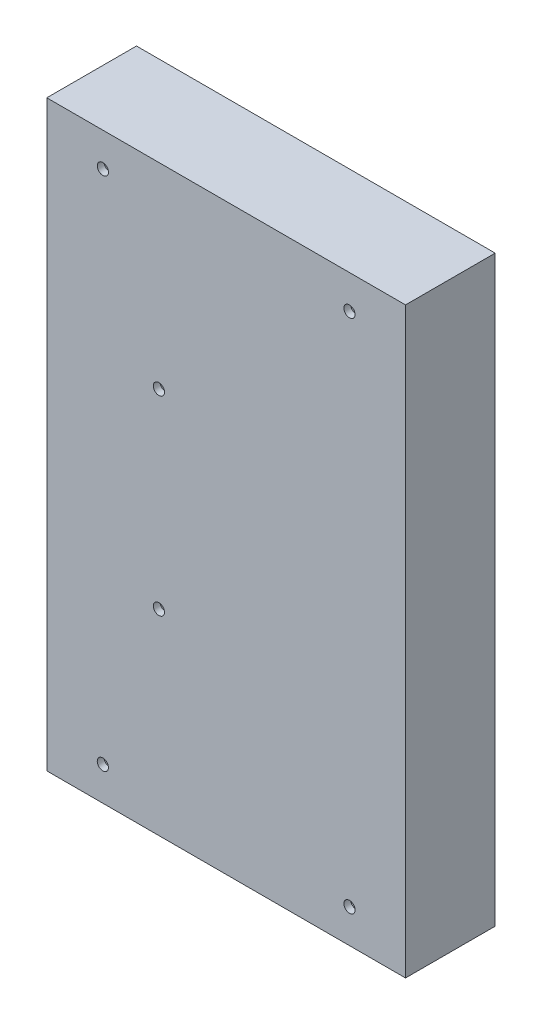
ISO-10303-21;
HEADER;
FILE_DESCRIPTION(('STEP AP214'),'2;1');
FILE_NAME('part.step','',(''),(''),'','','');
FILE_SCHEMA(('AUTOMOTIVE_DESIGN { 1 0 10303 214 1 1 1 1 }'));
ENDSEC;
DATA;
#1=APPLICATION_CONTEXT('core data for automotive mechanical design processes');
#2=APPLICATION_PROTOCOL_DEFINITION('international standard','automotive_design',2000,#1);
#3=PRODUCT_CONTEXT('',#1,'mechanical');
#4=PRODUCT('Part','Part','',(#3));
#5=PRODUCT_RELATED_PRODUCT_CATEGORY('part','',(#4));
#6=PRODUCT_DEFINITION_FORMATION('','',#4);
#7=PRODUCT_DEFINITION_CONTEXT('part definition',#1,'design');
#8=PRODUCT_DEFINITION('design','',#6,#7);
#9=PRODUCT_DEFINITION_SHAPE('','',#8);
#10=(LENGTH_UNIT() NAMED_UNIT(*) SI_UNIT(.MILLI.,.METRE.));
#11=(NAMED_UNIT(*) PLANE_ANGLE_UNIT() SI_UNIT($,.RADIAN.));
#12=(NAMED_UNIT(*) SI_UNIT($,.STERADIAN.) SOLID_ANGLE_UNIT());
#13=UNCERTAINTY_MEASURE_WITH_UNIT(LENGTH_MEASURE(1.E-05),#10,'distance_accuracy_value','');
#14=(GEOMETRIC_REPRESENTATION_CONTEXT(3) GLOBAL_UNCERTAINTY_ASSIGNED_CONTEXT((#13)) GLOBAL_UNIT_ASSIGNED_CONTEXT((#10,
#11,#12)) REPRESENTATION_CONTEXT('',''));
#15=CARTESIAN_POINT('',(0.,0.,0.));
#16=DIRECTION('',(0.,0.,1.));
#17=DIRECTION('',(1.,0.,0.));
#18=AXIS2_PLACEMENT_3D('',#15,#16,#17);
#19=CARTESIAN_POINT('',(-75.,-125.,25.));
#20=DIRECTION('',(1.,0.,0.));
#21=DIRECTION('',(0.,0.,-1.));
#22=AXIS2_PLACEMENT_3D('',#19,#20,#21);
#23=PLANE('',#22);
#24=DIRECTION('',(0.,0.,-1.));
#25=VECTOR('',#24,1.);
#26=CARTESIAN_POINT('',(-75.,125.,25.));
#27=LINE('',#26,#25);
#28=CARTESIAN_POINT('',(-75.,125.,20.));
#29=VERTEX_POINT('',#28);
#30=CARTESIAN_POINT('',(-75.,125.,10.));
#31=VERTEX_POINT('',#30);
#32=EDGE_CURVE('E200',#29,#31,#27,.T.);
#33=ORIENTED_EDGE('',*,*,#32,.F.);
#34=DIRECTION('',(0.,-1.,0.));
#35=VECTOR('',#34,1.);
#36=CARTESIAN_POINT('',(-75.,-125.,20.));
#37=LINE('',#36,#35);
#38=CARTESIAN_POINT('',(-75.,-125.,20.));
#39=VERTEX_POINT('',#38);
#40=EDGE_CURVE('E60',#29,#39,#37,.T.);
#41=ORIENTED_EDGE('',*,*,#40,.T.);
#42=DIRECTION('',(0.,0.,-1.));
#43=VECTOR('',#42,1.);
#44=CARTESIAN_POINT('',(-75.,-125.,25.));
#45=LINE('',#44,#43);
#46=CARTESIAN_POINT('',(-75.,-125.,10.));
#47=VERTEX_POINT('',#46);
#48=EDGE_CURVE('E66',#39,#47,#45,.T.);
#49=ORIENTED_EDGE('',*,*,#48,.T.);
#50=DIRECTION('',(0.,-1.,0.));
#51=VECTOR('',#50,1.);
#52=CARTESIAN_POINT('',(-75.,-125.,10.));
#53=LINE('',#52,#51);
#54=EDGE_CURVE('E535',#31,#47,#53,.T.);
#55=ORIENTED_EDGE('',*,*,#54,.F.);
#56=EDGE_LOOP('',(#33,#41,#49,#55));
#57=FACE_BOUND('',#56,.T.);
#58=ADVANCED_FACE('F45',(#57),#23,.T.);
#59=CARTESIAN_POINT('',(75.,-125.,25.));
#60=DIRECTION('',(0.,1.,0.));
#61=DIRECTION('',(0.,0.,1.));
#62=AXIS2_PLACEMENT_3D('',#59,#60,#61);
#63=PLANE('',#62);
#64=ORIENTED_EDGE('',*,*,#48,.F.);
#65=DIRECTION('',(1.,0.,0.));
#66=VECTOR('',#65,1.);
#67=CARTESIAN_POINT('',(75.,-125.,20.));
#68=LINE('',#67,#66);
#69=CARTESIAN_POINT('',(75.,-125.,20.));
#70=VERTEX_POINT('',#69);
#71=EDGE_CURVE('E193',#39,#70,#68,.T.);
#72=ORIENTED_EDGE('',*,*,#71,.T.);
#73=DIRECTION('',(0.,0.,-1.));
#74=VECTOR('',#73,1.);
#75=CARTESIAN_POINT('',(75.,-125.,25.));
#76=LINE('',#75,#74);
#77=CARTESIAN_POINT('',(75.,-125.,10.));
#78=VERTEX_POINT('',#77);
#79=EDGE_CURVE('E192',#70,#78,#76,.T.);
#80=ORIENTED_EDGE('',*,*,#79,.T.);
#81=DIRECTION('',(1.,0.,0.));
#82=VECTOR('',#81,1.);
#83=CARTESIAN_POINT('',(75.,-125.,10.));
#84=LINE('',#83,#82);
#85=EDGE_CURVE('E954',#47,#78,#84,.T.);
#86=ORIENTED_EDGE('',*,*,#85,.F.);
#87=EDGE_LOOP('',(#64,#72,#80,#86));
#88=FACE_BOUND('',#87,.T.);
#89=ADVANCED_FACE('F416',(#88),#63,.T.);
#90=CARTESIAN_POINT('',(75.,-125.,25.));
#91=DIRECTION('',(-1.,0.,0.));
#92=DIRECTION('',(0.,0.,1.));
#93=AXIS2_PLACEMENT_3D('',#90,#91,#92);
#94=PLANE('',#93);
#95=ORIENTED_EDGE('',*,*,#79,.F.);
#96=DIRECTION('',(0.,1.,0.));
#97=VECTOR('',#96,1.);
#98=CARTESIAN_POINT('',(75.,-125.,20.));
#99=LINE('',#98,#97);
#100=CARTESIAN_POINT('',(75.,125.,20.));
#101=VERTEX_POINT('',#100);
#102=EDGE_CURVE('E181',#70,#101,#99,.T.);
#103=ORIENTED_EDGE('',*,*,#102,.T.);
#104=DIRECTION('',(0.,0.,-1.));
#105=VECTOR('',#104,1.);
#106=CARTESIAN_POINT('',(75.,125.,25.));
#107=LINE('',#106,#105);
#108=CARTESIAN_POINT('',(75.,125.,10.));
#109=VERTEX_POINT('',#108);
#110=EDGE_CURVE('E190',#101,#109,#107,.T.);
#111=ORIENTED_EDGE('',*,*,#110,.T.);
#112=DIRECTION('',(0.,1.,0.));
#113=VECTOR('',#112,1.);
#114=CARTESIAN_POINT('',(75.,-125.,10.));
#115=LINE('',#114,#113);
#116=EDGE_CURVE('E956',#78,#109,#115,.T.);
#117=ORIENTED_EDGE('',*,*,#116,.F.);
#118=EDGE_LOOP('',(#95,#103,#111,#117));
#119=FACE_BOUND('',#118,.T.);
#120=ADVANCED_FACE('F188',(#119),#94,.T.);
#121=CARTESIAN_POINT('',(75.,125.,25.));
#122=DIRECTION('',(0.,-1.,0.));
#123=DIRECTION('',(0.,0.,-1.));
#124=AXIS2_PLACEMENT_3D('',#121,#122,#123);
#125=PLANE('',#124);
#126=ORIENTED_EDGE('',*,*,#110,.F.);
#127=DIRECTION('',(-1.,0.,0.));
#128=VECTOR('',#127,1.);
#129=CARTESIAN_POINT('',(75.,125.,20.));
#130=LINE('',#129,#128);
#131=EDGE_CURVE('E11',#101,#29,#130,.T.);
#132=ORIENTED_EDGE('',*,*,#131,.T.);
#133=ORIENTED_EDGE('',*,*,#32,.T.);
#134=DIRECTION('',(-1.,0.,0.));
#135=VECTOR('',#134,1.);
#136=CARTESIAN_POINT('',(75.,125.,10.));
#137=LINE('',#136,#135);
#138=EDGE_CURVE('E199',#109,#31,#137,.T.);
#139=ORIENTED_EDGE('',*,*,#138,.F.);
#140=EDGE_LOOP('',(#126,#132,#133,#139));
#141=FACE_BOUND('',#140,.T.);
#142=ADVANCED_FACE('F197',(#141),#125,.T.);
#143=CARTESIAN_POINT('',(0.,0.,0.));
#144=DIRECTION('',(0.,0.,1.));
#145=DIRECTION('',(1.,0.,0.));
#146=AXIS2_PLACEMENT_3D('',#143,#144,#145);
#147=PLANE('',#146);
#148=CARTESIAN_POINT('',(50.,100.,0.));
#149=DIRECTION('',(0.,0.,1.));
#150=DIRECTION('',(-1.,0.,0.));
#151=AXIS2_PLACEMENT_3D('',#148,#149,#150);
#152=CIRCLE('',#151,19.5);
#153=CARTESIAN_POINT('',(30.5,100.,0.));
#154=VERTEX_POINT('',#153);
#155=EDGE_CURVE('E329',#154,#154,#152,.T.);
#156=ORIENTED_EDGE('',*,*,#155,.T.);
#157=EDGE_LOOP('',(#156));
#158=FACE_BOUND('',#157,.T.);
#159=CARTESIAN_POINT('',(50.,40.,0.));
#160=DIRECTION('',(0.,0.,1.));
#161=DIRECTION('',(-1.,0.,0.));
#162=AXIS2_PLACEMENT_3D('',#159,#160,#161);
#163=CIRCLE('',#162,19.5);
#164=CARTESIAN_POINT('',(30.5,40.,0.));
#165=VERTEX_POINT('',#164);
#166=EDGE_CURVE('E335',#165,#165,#163,.T.);
#167=ORIENTED_EDGE('',*,*,#166,.T.);
#168=EDGE_LOOP('',(#167));
#169=FACE_BOUND('',#168,.T.);
#170=CARTESIAN_POINT('',(50.,-20.,0.));
#171=DIRECTION('',(0.,0.,1.));
#172=DIRECTION('',(-1.,0.,0.));
#173=AXIS2_PLACEMENT_3D('',#170,#171,#172);
#174=CIRCLE('',#173,19.5);
#175=CARTESIAN_POINT('',(30.5,-20.,0.));
#176=VERTEX_POINT('',#175);
#177=EDGE_CURVE('E341',#176,#176,#174,.T.);
#178=ORIENTED_EDGE('',*,*,#177,.T.);
#179=EDGE_LOOP('',(#178));
#180=FACE_BOUND('',#179,.T.);
#181=DIRECTION('',(0.,-1.,0.));
#182=VECTOR('',#181,1.);
#183=CARTESIAN_POINT('',(5.,125.,0.));
#184=LINE('',#183,#182);
#185=CARTESIAN_POINT('',(5.,125.,0.));
#186=VERTEX_POINT('',#185);
#187=CARTESIAN_POINT('',(4.99999999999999,4.99999999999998,0.));
#188=VERTEX_POINT('',#187);
#189=EDGE_CURVE('E219',#186,#188,#184,.T.);
#190=ORIENTED_EDGE('',*,*,#189,.F.);
#191=DIRECTION('',(-1.,0.,0.));
#192=VECTOR('',#191,1.);
#193=CARTESIAN_POINT('',(75.,125.,0.));
#194=LINE('',#193,#192);
#195=CARTESIAN_POINT('',(75.,125.,0.));
#196=VERTEX_POINT('',#195);
#197=EDGE_CURVE('E53',#196,#186,#194,.T.);
#198=ORIENTED_EDGE('',*,*,#197,.F.);
#199=DIRECTION('',(0.,1.,0.));
#200=VECTOR('',#199,1.);
#201=CARTESIAN_POINT('',(75.,-125.,0.));
#202=LINE('',#201,#200);
#203=CARTESIAN_POINT('',(75.,-115.,0.));
#204=VERTEX_POINT('',#203);
#205=EDGE_CURVE('E373',#204,#196,#202,.T.);
#206=ORIENTED_EDGE('',*,*,#205,.F.);
#207=DIRECTION('',(0.503871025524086,-0.863778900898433,0.));
#208=VECTOR('',#207,1.);
#209=CARTESIAN_POINT('',(75.,-115.,0.));
#210=LINE('',#209,#208);
#211=EDGE_CURVE('E238',#188,#204,#210,.T.);
#212=ORIENTED_EDGE('',*,*,#211,.F.);
#213=EDGE_LOOP('',(#190,#198,#206,#212));
#214=FACE_BOUND('',#213,.T.);
#215=ADVANCED_FACE('F47',(#158,#169,#180,#214),#147,.F.);
#216=CARTESIAN_POINT('',(0.,-40.0000000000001,0.));
#217=DIRECTION('',(0.,0.,1.));
#218=DIRECTION('',(1.,0.,0.));
#219=AXIS2_PLACEMENT_3D('',#216,#217,#218);
#220=CIRCLE('',#219,19.5);
#221=CARTESIAN_POINT('',(19.5,-40.0000000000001,0.));
#222=VERTEX_POINT('',#221);
#223=EDGE_CURVE('E308',#222,#222,#220,.T.);
#224=ORIENTED_EDGE('',*,*,#223,.T.);
#225=EDGE_LOOP('',(#224));
#226=FACE_BOUND('',#225,.T.);
#227=CARTESIAN_POINT('',(29.9999999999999,-100.,0.));
#228=DIRECTION('',(0.,0.,1.));
#229=DIRECTION('',(-1.,0.,0.));
#230=AXIS2_PLACEMENT_3D('',#227,#228,#229);
#231=CIRCLE('',#230,19.5);
#232=CARTESIAN_POINT('',(10.4999999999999,-100.,0.));
#233=VERTEX_POINT('',#232);
#234=EDGE_CURVE('E317',#233,#233,#231,.T.);
#235=ORIENTED_EDGE('',*,*,#234,.T.);
#236=EDGE_LOOP('',(#235));
#237=FACE_BOUND('',#236,.T.);
#238=CARTESIAN_POINT('',(-29.9999999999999,-100.,0.));
#239=DIRECTION('',(0.,0.,1.));
#240=DIRECTION('',(1.,0.,0.));
#241=AXIS2_PLACEMENT_3D('',#238,#239,#240);
#242=CIRCLE('',#241,19.5);
#243=CARTESIAN_POINT('',(-10.4999999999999,-100.,0.));
#244=VERTEX_POINT('',#243);
#245=EDGE_CURVE('E323',#244,#244,#242,.T.);
#246=ORIENTED_EDGE('',*,*,#245,.T.);
#247=EDGE_LOOP('',(#246));
#248=FACE_BOUND('',#247,.T.);
#249=DIRECTION('',(-0.503871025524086,0.863778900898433,0.));
#250=VECTOR('',#249,1.);
#251=CARTESIAN_POINT('',(3.8302151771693,-2.9946545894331,0.));
#252=LINE('',#251,#250);
#253=CARTESIAN_POINT('',(75.,-125.,0.));
#254=VERTEX_POINT('',#253);
#255=CARTESIAN_POINT('',(3.8302151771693,-2.9946545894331,0.));
#256=VERTEX_POINT('',#255);
#257=EDGE_CURVE('E240',#254,#256,#252,.T.);
#258=ORIENTED_EDGE('',*,*,#257,.F.);
#259=DIRECTION('',(1.,0.,0.));
#260=VECTOR('',#259,1.);
#261=CARTESIAN_POINT('',(75.,-125.,0.));
#262=LINE('',#261,#260);
#263=CARTESIAN_POINT('',(-75.,-125.,0.));
#264=VERTEX_POINT('',#263);
#265=EDGE_CURVE('E370',#264,#254,#262,.T.);
#266=ORIENTED_EDGE('',*,*,#265,.F.);
#267=DIRECTION('',(-0.503871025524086,-0.863778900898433,0.));
#268=VECTOR('',#267,1.);
#269=CARTESIAN_POINT('',(-3.8302151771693,-2.9946545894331,0.));
#270=LINE('',#269,#268);
#271=CARTESIAN_POINT('',(-3.8302151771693,-2.9946545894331,0.));
#272=VERTEX_POINT('',#271);
#273=EDGE_CURVE('E244',#272,#264,#270,.T.);
#274=ORIENTED_EDGE('',*,*,#273,.F.);
#275=DIRECTION('',(-1.,0.,0.));
#276=VECTOR('',#275,1.);
#277=CARTESIAN_POINT('',(3.8302151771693,-2.9946545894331,0.));
#278=LINE('',#277,#276);
#279=EDGE_CURVE('E242',#256,#272,#278,.T.);
#280=ORIENTED_EDGE('',*,*,#279,.F.);
#281=EDGE_LOOP('',(#258,#266,#274,#280));
#282=FACE_BOUND('',#281,.T.);
#283=ADVANCED_FACE('F557',(#226,#237,#248,#282),#147,.F.);
#284=CARTESIAN_POINT('',(-50.,-20.,0.));
#285=DIRECTION('',(0.,0.,1.));
#286=DIRECTION('',(1.,0.,0.));
#287=AXIS2_PLACEMENT_3D('',#284,#285,#286);
#288=CIRCLE('',#287,19.5);
#289=CARTESIAN_POINT('',(-30.5,-20.,0.));
#290=VERTEX_POINT('',#289);
#291=EDGE_CURVE('E347',#290,#290,#288,.T.);
#292=ORIENTED_EDGE('',*,*,#291,.T.);
#293=EDGE_LOOP('',(#292));
#294=FACE_BOUND('',#293,.T.);
#295=CARTESIAN_POINT('',(-50.,40.,0.));
#296=DIRECTION('',(0.,0.,1.));
#297=DIRECTION('',(1.,0.,0.));
#298=AXIS2_PLACEMENT_3D('',#295,#296,#297);
#299=CIRCLE('',#298,19.5);
#300=CARTESIAN_POINT('',(-30.5,40.,0.));
#301=VERTEX_POINT('',#300);
#302=EDGE_CURVE('E353',#301,#301,#299,.T.);
#303=ORIENTED_EDGE('',*,*,#302,.T.);
#304=EDGE_LOOP('',(#303));
#305=FACE_BOUND('',#304,.T.);
#306=CARTESIAN_POINT('',(-50.,100.,0.));
#307=DIRECTION('',(0.,0.,1.));
#308=DIRECTION('',(1.,0.,0.));
#309=AXIS2_PLACEMENT_3D('',#306,#307,#308);
#310=CIRCLE('',#309,19.5);
#311=CARTESIAN_POINT('',(-30.5,100.,0.));
#312=VERTEX_POINT('',#311);
#313=EDGE_CURVE('E359',#312,#312,#310,.T.);
#314=ORIENTED_EDGE('',*,*,#313,.T.);
#315=EDGE_LOOP('',(#314));
#316=FACE_BOUND('',#315,.T.);
#317=DIRECTION('',(0.503871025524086,0.863778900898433,0.));
#318=VECTOR('',#317,1.);
#319=CARTESIAN_POINT('',(-75.,-115.,0.));
#320=LINE('',#319,#318);
#321=CARTESIAN_POINT('',(-75.,-115.,0.));
#322=VERTEX_POINT('',#321);
#323=CARTESIAN_POINT('',(-4.12771466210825,6.49534629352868,0.));
#324=VERTEX_POINT('',#323);
#325=EDGE_CURVE('E246',#322,#324,#320,.T.);
#326=ORIENTED_EDGE('',*,*,#325,.F.);
#327=DIRECTION('',(0.,-1.,0.));
#328=VECTOR('',#327,1.);
#329=CARTESIAN_POINT('',(-75.,-125.,0.));
#330=LINE('',#329,#328);
#331=CARTESIAN_POINT('',(-75.,125.,0.));
#332=VERTEX_POINT('',#331);
#333=EDGE_CURVE('E365',#332,#322,#330,.T.);
#334=ORIENTED_EDGE('',*,*,#333,.F.);
#335=CARTESIAN_POINT('',(-5.,125.,0.));
#336=VERTEX_POINT('',#335);
#337=EDGE_CURVE('E374',#336,#332,#194,.T.);
#338=ORIENTED_EDGE('',*,*,#337,.F.);
#339=DIRECTION('',(-0.00736056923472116,0.999972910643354,0.));
#340=VECTOR('',#339,1.);
#341=CARTESIAN_POINT('',(-5.,125.,0.));
#342=LINE('',#341,#340);
#343=EDGE_CURVE('E223',#324,#336,#342,.T.);
#344=ORIENTED_EDGE('',*,*,#343,.F.);
#345=EDGE_LOOP('',(#326,#334,#338,#344));
#346=FACE_BOUND('',#345,.T.);
#347=ADVANCED_FACE('F390',(#294,#305,#316,#346),#147,.F.);
#348=CARTESIAN_POINT('',(75.,125.,-15.));
#349=DIRECTION('',(0.,1.,0.));
#350=DIRECTION('',(0.,0.,1.));
#351=AXIS2_PLACEMENT_3D('',#348,#349,#350);
#352=PLANE('',#351);
#353=DIRECTION('',(0.,0.,1.));
#354=VECTOR('',#353,1.);
#355=CARTESIAN_POINT('',(5.,125.,-15.));
#356=LINE('',#355,#354);
#357=CARTESIAN_POINT('',(5.,125.,-15.));
#358=VERTEX_POINT('',#357);
#359=EDGE_CURVE('E268',#358,#186,#356,.T.);
#360=ORIENTED_EDGE('',*,*,#359,.F.);
#361=DIRECTION('',(-1.,0.,0.));
#362=VECTOR('',#361,1.);
#363=CARTESIAN_POINT('',(75.,125.,-15.));
#364=LINE('',#363,#362);
#365=CARTESIAN_POINT('',(75.,125.,-15.));
#366=VERTEX_POINT('',#365);
#367=EDGE_CURVE('E279',#366,#358,#364,.T.);
#368=ORIENTED_EDGE('',*,*,#367,.F.);
#369=DIRECTION('',(0.,0.,1.));
#370=VECTOR('',#369,1.);
#371=CARTESIAN_POINT('',(75.,125.,-15.));
#372=LINE('',#371,#370);
#373=EDGE_CURVE('E287',#366,#196,#372,.T.);
#374=ORIENTED_EDGE('',*,*,#373,.T.);
#375=ORIENTED_EDGE('',*,*,#197,.T.);
#376=EDGE_LOOP('',(#360,#368,#374,#375));
#377=FACE_BOUND('',#376,.T.);
#378=ADVANCED_FACE('F593',(#377),#352,.F.);
#379=DIRECTION('',(0.,0.,1.));
#380=VECTOR('',#379,1.);
#381=CARTESIAN_POINT('',(-5.,125.,-15.));
#382=LINE('',#381,#380);
#383=CARTESIAN_POINT('',(-5.,125.,-15.));
#384=VERTEX_POINT('',#383);
#385=EDGE_CURVE('E236',#384,#336,#382,.T.);
#386=ORIENTED_EDGE('',*,*,#385,.T.);
#387=ORIENTED_EDGE('',*,*,#337,.T.);
#388=DIRECTION('',(0.,0.,1.));
#389=VECTOR('',#388,1.);
#390=CARTESIAN_POINT('',(-75.,125.,-15.));
#391=LINE('',#390,#389);
#392=CARTESIAN_POINT('',(-75.,125.,-15.));
#393=VERTEX_POINT('',#392);
#394=EDGE_CURVE('E283',#393,#332,#391,.T.);
#395=ORIENTED_EDGE('',*,*,#394,.F.);
#396=EDGE_CURVE('E278',#384,#393,#364,.T.);
#397=ORIENTED_EDGE('',*,*,#396,.F.);
#398=EDGE_LOOP('',(#386,#387,#395,#397));
#399=FACE_BOUND('',#398,.T.);
#400=ADVANCED_FACE('F383',(#399),#352,.F.);
#401=CARTESIAN_POINT('',(-75.,-125.,-15.));
#402=DIRECTION('',(-1.,0.,0.));
#403=DIRECTION('',(0.,0.,1.));
#404=AXIS2_PLACEMENT_3D('',#401,#402,#403);
#405=PLANE('',#404);
#406=DIRECTION('',(0.,0.,1.));
#407=VECTOR('',#406,1.);
#408=CARTESIAN_POINT('',(-75.,-115.,-15.));
#409=LINE('',#408,#407);
#410=CARTESIAN_POINT('',(-75.,-115.,-15.));
#411=VERTEX_POINT('',#410);
#412=EDGE_CURVE('E254',#411,#322,#409,.T.);
#413=ORIENTED_EDGE('',*,*,#412,.F.);
#414=DIRECTION('',(0.,-1.,0.));
#415=VECTOR('',#414,1.);
#416=CARTESIAN_POINT('',(-75.,-125.,-15.));
#417=LINE('',#416,#415);
#418=EDGE_CURVE('E270',#393,#411,#417,.T.);
#419=ORIENTED_EDGE('',*,*,#418,.F.);
#420=ORIENTED_EDGE('',*,*,#394,.T.);
#421=ORIENTED_EDGE('',*,*,#333,.T.);
#422=EDGE_LOOP('',(#413,#419,#420,#421));
#423=FACE_BOUND('',#422,.T.);
#424=ADVANCED_FACE('F393',(#423),#405,.F.);
#425=CARTESIAN_POINT('',(75.,-125.,-15.));
#426=DIRECTION('',(1.,0.,0.));
#427=DIRECTION('',(0.,0.,-1.));
#428=AXIS2_PLACEMENT_3D('',#425,#426,#427);
#429=PLANE('',#428);
#430=DIRECTION('',(0.,0.,1.));
#431=VECTOR('',#430,1.);
#432=CARTESIAN_POINT('',(75.,-115.,-15.));
#433=LINE('',#432,#431);
#434=CARTESIAN_POINT('',(75.,-115.,-15.));
#435=VERTEX_POINT('',#434);
#436=EDGE_CURVE('E262',#435,#204,#433,.T.);
#437=ORIENTED_EDGE('',*,*,#436,.T.);
#438=ORIENTED_EDGE('',*,*,#205,.T.);
#439=ORIENTED_EDGE('',*,*,#373,.F.);
#440=DIRECTION('',(0.,1.,0.));
#441=VECTOR('',#440,1.);
#442=CARTESIAN_POINT('',(75.,-125.,-15.));
#443=LINE('',#442,#441);
#444=EDGE_CURVE('E276',#435,#366,#443,.T.);
#445=ORIENTED_EDGE('',*,*,#444,.F.);
#446=EDGE_LOOP('',(#437,#438,#439,#445));
#447=FACE_BOUND('',#446,.T.);
#448=ADVANCED_FACE('F526',(#447),#429,.F.);
#449=CARTESIAN_POINT('',(0.,0.,10.));
#450=DIRECTION('',(0.,0.,1.));
#451=DIRECTION('',(1.,0.,0.));
#452=AXIS2_PLACEMENT_3D('',#449,#450,#451);
#453=PLANE('',#452);
#454=ORIENTED_EDGE('',*,*,#54,.T.);
#455=ORIENTED_EDGE('',*,*,#85,.T.);
#456=ORIENTED_EDGE('',*,*,#116,.T.);
#457=ORIENTED_EDGE('',*,*,#138,.T.);
#458=EDGE_LOOP('',(#454,#455,#456,#457));
#459=FACE_BOUND('',#458,.T.);
#460=CARTESIAN_POINT('',(29.9999999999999,-100.,10.));
#461=DIRECTION('',(0.,0.,1.));
#462=DIRECTION('',(-1.,0.,0.));
#463=AXIS2_PLACEMENT_3D('',#460,#461,#462);
#464=CIRCLE('',#463,19.5);
#465=CARTESIAN_POINT('',(10.4999999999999,-100.,10.));
#466=VERTEX_POINT('',#465);
#467=EDGE_CURVE('E320',#466,#466,#464,.T.);
#468=ORIENTED_EDGE('',*,*,#467,.F.);
#469=EDGE_LOOP('',(#468));
#470=FACE_BOUND('',#469,.T.);
#471=CARTESIAN_POINT('',(50.,100.,10.));
#472=DIRECTION('',(0.,0.,1.));
#473=DIRECTION('',(-1.,0.,0.));
#474=AXIS2_PLACEMENT_3D('',#471,#472,#473);
#475=CIRCLE('',#474,19.5);
#476=CARTESIAN_POINT('',(30.5,100.,10.));
#477=VERTEX_POINT('',#476);
#478=EDGE_CURVE('E332',#477,#477,#475,.T.);
#479=ORIENTED_EDGE('',*,*,#478,.F.);
#480=EDGE_LOOP('',(#479));
#481=FACE_BOUND('',#480,.T.);
#482=CARTESIAN_POINT('',(50.,-20.,10.));
#483=DIRECTION('',(0.,0.,1.));
#484=DIRECTION('',(-1.,0.,0.));
#485=AXIS2_PLACEMENT_3D('',#482,#483,#484);
#486=CIRCLE('',#485,19.5);
#487=CARTESIAN_POINT('',(30.5,-20.,10.));
#488=VERTEX_POINT('',#487);
#489=EDGE_CURVE('E344',#488,#488,#486,.T.);
#490=ORIENTED_EDGE('',*,*,#489,.F.);
#491=EDGE_LOOP('',(#490));
#492=FACE_BOUND('',#491,.T.);
#493=CARTESIAN_POINT('',(-50.,40.,10.));
#494=DIRECTION('',(0.,0.,1.));
#495=DIRECTION('',(1.,0.,0.));
#496=AXIS2_PLACEMENT_3D('',#493,#494,#495);
#497=CIRCLE('',#496,19.5);
#498=CARTESIAN_POINT('',(-30.5,40.,10.));
#499=VERTEX_POINT('',#498);
#500=EDGE_CURVE('E356',#499,#499,#497,.T.);
#501=ORIENTED_EDGE('',*,*,#500,.F.);
#502=EDGE_LOOP('',(#501));
#503=FACE_BOUND('',#502,.T.);
#504=CARTESIAN_POINT('',(-50.,100.,10.));
#505=DIRECTION('',(0.,0.,1.));
#506=DIRECTION('',(1.,0.,0.));
#507=AXIS2_PLACEMENT_3D('',#504,#505,#506);
#508=CIRCLE('',#507,19.5);
#509=CARTESIAN_POINT('',(-30.5,100.,10.));
#510=VERTEX_POINT('',#509);
#511=EDGE_CURVE('E362',#510,#510,#508,.T.);
#512=ORIENTED_EDGE('',*,*,#511,.F.);
#513=EDGE_LOOP('',(#512));
#514=FACE_BOUND('',#513,.T.);
#515=CARTESIAN_POINT('',(-50.,-20.,10.));
#516=DIRECTION('',(0.,0.,1.));
#517=DIRECTION('',(1.,0.,0.));
#518=AXIS2_PLACEMENT_3D('',#515,#516,#517);
#519=CIRCLE('',#518,19.5);
#520=CARTESIAN_POINT('',(-30.5,-20.,10.));
#521=VERTEX_POINT('',#520);
#522=EDGE_CURVE('E350',#521,#521,#519,.T.);
#523=ORIENTED_EDGE('',*,*,#522,.F.);
#524=EDGE_LOOP('',(#523));
#525=FACE_BOUND('',#524,.T.);
#526=CARTESIAN_POINT('',(50.,40.,10.));
#527=DIRECTION('',(0.,0.,1.));
#528=DIRECTION('',(-1.,0.,0.));
#529=AXIS2_PLACEMENT_3D('',#526,#527,#528);
#530=CIRCLE('',#529,19.5);
#531=CARTESIAN_POINT('',(30.5,40.,10.));
#532=VERTEX_POINT('',#531);
#533=EDGE_CURVE('E338',#532,#532,#530,.T.);
#534=ORIENTED_EDGE('',*,*,#533,.F.);
#535=EDGE_LOOP('',(#534));
#536=FACE_BOUND('',#535,.T.);
#537=CARTESIAN_POINT('',(-29.9999999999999,-100.,10.));
#538=DIRECTION('',(0.,0.,1.));
#539=DIRECTION('',(1.,0.,0.));
#540=AXIS2_PLACEMENT_3D('',#537,#538,#539);
#541=CIRCLE('',#540,19.5);
#542=CARTESIAN_POINT('',(-10.4999999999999,-100.,10.));
#543=VERTEX_POINT('',#542);
#544=EDGE_CURVE('E326',#543,#543,#541,.T.);
#545=ORIENTED_EDGE('',*,*,#544,.F.);
#546=EDGE_LOOP('',(#545));
#547=FACE_BOUND('',#546,.T.);
#548=CARTESIAN_POINT('',(0.,-40.0000000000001,10.));
#549=DIRECTION('',(0.,0.,1.));
#550=DIRECTION('',(1.,0.,0.));
#551=AXIS2_PLACEMENT_3D('',#548,#549,#550);
#552=CIRCLE('',#551,19.5);
#553=CARTESIAN_POINT('',(19.5,-40.0000000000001,10.));
#554=VERTEX_POINT('',#553);
#555=EDGE_CURVE('E314',#554,#554,#552,.T.);
#556=ORIENTED_EDGE('',*,*,#555,.F.);
#557=EDGE_LOOP('',(#556));
#558=FACE_BOUND('',#557,.T.);
#559=ADVANCED_FACE('F524',(#459,#470,#481,#492,#503,#514,#525,#536,#547,#558),#453,.T.);
#560=CARTESIAN_POINT('',(-50.,100.,10.));
#561=DIRECTION('',(0.,0.,-1.));
#562=DIRECTION('',(-1.,0.,0.));
#563=AXIS2_PLACEMENT_3D('',#560,#561,#562);
#564=CYLINDRICAL_SURFACE('',#563,19.5);
#565=ORIENTED_EDGE('',*,*,#511,.T.);
#566=EDGE_LOOP('',(#565));
#567=FACE_BOUND('',#566,.T.);
#568=ORIENTED_EDGE('',*,*,#313,.F.);
#569=EDGE_LOOP('',(#568));
#570=FACE_BOUND('',#569,.T.);
#571=ADVANCED_FACE('F521',(#567,#570),#564,.F.);
#572=CARTESIAN_POINT('',(-50.,40.,10.));
#573=DIRECTION('',(0.,0.,-1.));
#574=DIRECTION('',(-1.,0.,0.));
#575=AXIS2_PLACEMENT_3D('',#572,#573,#574);
#576=CYLINDRICAL_SURFACE('',#575,19.5);
#577=ORIENTED_EDGE('',*,*,#500,.T.);
#578=EDGE_LOOP('',(#577));
#579=FACE_BOUND('',#578,.T.);
#580=ORIENTED_EDGE('',*,*,#302,.F.);
#581=EDGE_LOOP('',(#580));
#582=FACE_BOUND('',#581,.T.);
#583=ADVANCED_FACE('F517',(#579,#582),#576,.F.);
#584=CARTESIAN_POINT('',(-50.,-20.,10.));
#585=DIRECTION('',(0.,0.,-1.));
#586=DIRECTION('',(-1.,0.,0.));
#587=AXIS2_PLACEMENT_3D('',#584,#585,#586);
#588=CYLINDRICAL_SURFACE('',#587,19.5);
#589=ORIENTED_EDGE('',*,*,#522,.T.);
#590=EDGE_LOOP('',(#589));
#591=FACE_BOUND('',#590,.T.);
#592=ORIENTED_EDGE('',*,*,#291,.F.);
#593=EDGE_LOOP('',(#592));
#594=FACE_BOUND('',#593,.T.);
#595=ADVANCED_FACE('F513',(#591,#594),#588,.F.);
#596=CARTESIAN_POINT('',(50.,-20.,10.));
#597=DIRECTION('',(0.,0.,-1.));
#598=DIRECTION('',(-1.,0.,0.));
#599=AXIS2_PLACEMENT_3D('',#596,#597,#598);
#600=CYLINDRICAL_SURFACE('',#599,19.5);
#601=ORIENTED_EDGE('',*,*,#489,.T.);
#602=EDGE_LOOP('',(#601));
#603=FACE_BOUND('',#602,.T.);
#604=ORIENTED_EDGE('',*,*,#177,.F.);
#605=EDGE_LOOP('',(#604));
#606=FACE_BOUND('',#605,.T.);
#607=ADVANCED_FACE('F509',(#603,#606),#600,.F.);
#608=CARTESIAN_POINT('',(50.,40.,10.));
#609=DIRECTION('',(0.,0.,-1.));
#610=DIRECTION('',(-1.,0.,0.));
#611=AXIS2_PLACEMENT_3D('',#608,#609,#610);
#612=CYLINDRICAL_SURFACE('',#611,19.5);
#613=ORIENTED_EDGE('',*,*,#533,.T.);
#614=EDGE_LOOP('',(#613));
#615=FACE_BOUND('',#614,.T.);
#616=ORIENTED_EDGE('',*,*,#166,.F.);
#617=EDGE_LOOP('',(#616));
#618=FACE_BOUND('',#617,.T.);
#619=ADVANCED_FACE('F505',(#615,#618),#612,.F.);
#620=CARTESIAN_POINT('',(50.,100.,10.));
#621=DIRECTION('',(0.,0.,-1.));
#622=DIRECTION('',(-1.,0.,0.));
#623=AXIS2_PLACEMENT_3D('',#620,#621,#622);
#624=CYLINDRICAL_SURFACE('',#623,19.5);
#625=ORIENTED_EDGE('',*,*,#478,.T.);
#626=EDGE_LOOP('',(#625));
#627=FACE_BOUND('',#626,.T.);
#628=ORIENTED_EDGE('',*,*,#155,.F.);
#629=EDGE_LOOP('',(#628));
#630=FACE_BOUND('',#629,.T.);
#631=ADVANCED_FACE('F501',(#627,#630),#624,.F.);
#632=CARTESIAN_POINT('',(-29.9999999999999,-100.,10.));
#633=DIRECTION('',(0.,0.,-1.));
#634=DIRECTION('',(-1.,0.,0.));
#635=AXIS2_PLACEMENT_3D('',#632,#633,#634);
#636=CYLINDRICAL_SURFACE('',#635,19.5);
#637=ORIENTED_EDGE('',*,*,#544,.T.);
#638=EDGE_LOOP('',(#637));
#639=FACE_BOUND('',#638,.T.);
#640=ORIENTED_EDGE('',*,*,#245,.F.);
#641=EDGE_LOOP('',(#640));
#642=FACE_BOUND('',#641,.T.);
#643=ADVANCED_FACE('F497',(#639,#642),#636,.F.);
#644=CARTESIAN_POINT('',(29.9999999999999,-100.,10.));
#645=DIRECTION('',(0.,0.,-1.));
#646=DIRECTION('',(-1.,0.,0.));
#647=AXIS2_PLACEMENT_3D('',#644,#645,#646);
#648=CYLINDRICAL_SURFACE('',#647,19.5);
#649=ORIENTED_EDGE('',*,*,#467,.T.);
#650=EDGE_LOOP('',(#649));
#651=FACE_BOUND('',#650,.T.);
#652=ORIENTED_EDGE('',*,*,#234,.F.);
#653=EDGE_LOOP('',(#652));
#654=FACE_BOUND('',#653,.T.);
#655=ADVANCED_FACE('F493',(#651,#654),#648,.F.);
#656=CARTESIAN_POINT('',(0.,-40.0000000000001,10.));
#657=DIRECTION('',(0.,0.,-1.));
#658=DIRECTION('',(-1.,0.,0.));
#659=AXIS2_PLACEMENT_3D('',#656,#657,#658);
#660=CYLINDRICAL_SURFACE('',#659,19.5);
#661=ORIENTED_EDGE('',*,*,#555,.T.);
#662=EDGE_LOOP('',(#661));
#663=FACE_BOUND('',#662,.T.);
#664=ORIENTED_EDGE('',*,*,#223,.F.);
#665=EDGE_LOOP('',(#664));
#666=FACE_BOUND('',#665,.T.);
#667=ADVANCED_FACE('F490',(#663,#666),#660,.F.);
#668=CARTESIAN_POINT('',(75.,-125.,-15.));
#669=DIRECTION('',(0.,-1.,0.));
#670=DIRECTION('',(0.,0.,-1.));
#671=AXIS2_PLACEMENT_3D('',#668,#669,#670);
#672=PLANE('',#671);
#673=DIRECTION('',(0.,0.,1.));
#674=VECTOR('',#673,1.);
#675=CARTESIAN_POINT('',(-75.,-125.,-15.));
#676=LINE('',#675,#674);
#677=CARTESIAN_POINT('',(-75.,-125.,-15.));
#678=VERTEX_POINT('',#677);
#679=EDGE_CURVE('E282',#678,#264,#676,.T.);
#680=ORIENTED_EDGE('',*,*,#679,.T.);
#681=ORIENTED_EDGE('',*,*,#265,.T.);
#682=DIRECTION('',(0.,0.,1.));
#683=VECTOR('',#682,1.);
#684=CARTESIAN_POINT('',(75.,-125.,-15.));
#685=LINE('',#684,#683);
#686=CARTESIAN_POINT('',(75.,-125.,-15.));
#687=VERTEX_POINT('',#686);
#688=EDGE_CURVE('E290',#687,#254,#685,.T.);
#689=ORIENTED_EDGE('',*,*,#688,.F.);
#690=DIRECTION('',(1.,0.,0.));
#691=VECTOR('',#690,1.);
#692=CARTESIAN_POINT('',(75.,-125.,-15.));
#693=LINE('',#692,#691);
#694=EDGE_CURVE('E273',#678,#687,#693,.T.);
#695=ORIENTED_EDGE('',*,*,#694,.F.);
#696=EDGE_LOOP('',(#680,#681,#689,#695));
#697=FACE_BOUND('',#696,.T.);
#698=ADVANCED_FACE('F483',(#697),#672,.F.);
#699=CARTESIAN_POINT('',(-80.,-130.,-15.));
#700=DIRECTION('',(-1.,0.,0.));
#701=DIRECTION('',(0.,0.,1.));
#702=AXIS2_PLACEMENT_3D('',#699,#700,#701);
#703=PLANE('',#702);
#704=DIRECTION('',(0.,-1.,0.));
#705=VECTOR('',#704,1.);
#706=CARTESIAN_POINT('',(-80.,-130.,25.));
#707=LINE('',#706,#705);
#708=CARTESIAN_POINT('',(-80.,130.,25.));
#709=VERTEX_POINT('',#708);
#710=CARTESIAN_POINT('',(-80.,-130.,25.));
#711=VERTEX_POINT('',#710);
#712=EDGE_CURVE('E207',#709,#711,#707,.T.);
#713=ORIENTED_EDGE('',*,*,#712,.F.);
#714=DIRECTION('',(0.,0.,1.));
#715=VECTOR('',#714,1.);
#716=CARTESIAN_POINT('',(-80.,130.,-15.));
#717=LINE('',#716,#715);
#718=CARTESIAN_POINT('',(-80.,130.,-15.));
#719=VERTEX_POINT('',#718);
#720=EDGE_CURVE('E306',#719,#709,#717,.T.);
#721=ORIENTED_EDGE('',*,*,#720,.F.);
#722=DIRECTION('',(0.,-1.,0.));
#723=VECTOR('',#722,1.);
#724=CARTESIAN_POINT('',(-80.,-130.,-15.));
#725=LINE('',#724,#723);
#726=CARTESIAN_POINT('',(-80.,-130.,-15.));
#727=VERTEX_POINT('',#726);
#728=EDGE_CURVE('E286',#719,#727,#725,.T.);
#729=ORIENTED_EDGE('',*,*,#728,.T.);
#730=DIRECTION('',(0.,0.,1.));
#731=VECTOR('',#730,1.);
#732=CARTESIAN_POINT('',(-80.,-130.,-15.));
#733=LINE('',#732,#731);
#734=EDGE_CURVE('E305',#727,#711,#733,.T.);
#735=ORIENTED_EDGE('',*,*,#734,.T.);
#736=EDGE_LOOP('',(#713,#721,#729,#735));
#737=FACE_BOUND('',#736,.T.);
#738=ADVANCED_FACE('F464',(#737),#703,.T.);
#739=CARTESIAN_POINT('',(80.,130.,-15.));
#740=DIRECTION('',(0.,1.,0.));
#741=DIRECTION('',(0.,0.,1.));
#742=AXIS2_PLACEMENT_3D('',#739,#740,#741);
#743=PLANE('',#742);
#744=DIRECTION('',(-1.,0.,0.));
#745=VECTOR('',#744,1.);
#746=CARTESIAN_POINT('',(80.,130.,25.));
#747=LINE('',#746,#745);
#748=CARTESIAN_POINT('',(80.,130.,25.));
#749=VERTEX_POINT('',#748);
#750=EDGE_CURVE('E216',#749,#709,#747,.T.);
#751=ORIENTED_EDGE('',*,*,#750,.F.);
#752=DIRECTION('',(0.,0.,1.));
#753=VECTOR('',#752,1.);
#754=CARTESIAN_POINT('',(80.,130.,-15.));
#755=LINE('',#754,#753);
#756=CARTESIAN_POINT('',(80.,130.,-15.));
#757=VERTEX_POINT('',#756);
#758=EDGE_CURVE('E309',#757,#749,#755,.T.);
#759=ORIENTED_EDGE('',*,*,#758,.F.);
#760=DIRECTION('',(-1.,0.,0.));
#761=VECTOR('',#760,1.);
#762=CARTESIAN_POINT('',(80.,130.,-15.));
#763=LINE('',#762,#761);
#764=EDGE_CURVE('E302',#757,#719,#763,.T.);
#765=ORIENTED_EDGE('',*,*,#764,.T.);
#766=ORIENTED_EDGE('',*,*,#720,.T.);
#767=EDGE_LOOP('',(#751,#759,#765,#766));
#768=FACE_BOUND('',#767,.T.);
#769=ADVANCED_FACE('F475',(#768),#743,.T.);
#770=CARTESIAN_POINT('',(80.,-130.,-15.));
#771=DIRECTION('',(1.,0.,0.));
#772=DIRECTION('',(0.,0.,-1.));
#773=AXIS2_PLACEMENT_3D('',#770,#771,#772);
#774=PLANE('',#773);
#775=DIRECTION('',(0.,1.,0.));
#776=VECTOR('',#775,1.);
#777=CARTESIAN_POINT('',(80.,-130.,25.));
#778=LINE('',#777,#776);
#779=CARTESIAN_POINT('',(80.,-130.,25.));
#780=VERTEX_POINT('',#779);
#781=EDGE_CURVE('E213',#780,#749,#778,.T.);
#782=ORIENTED_EDGE('',*,*,#781,.F.);
#783=DIRECTION('',(0.,0.,1.));
#784=VECTOR('',#783,1.);
#785=CARTESIAN_POINT('',(80.,-130.,-15.));
#786=LINE('',#785,#784);
#787=CARTESIAN_POINT('',(80.,-130.,-15.));
#788=VERTEX_POINT('',#787);
#789=EDGE_CURVE('E311',#788,#780,#786,.T.);
#790=ORIENTED_EDGE('',*,*,#789,.F.);
#791=DIRECTION('',(0.,1.,0.));
#792=VECTOR('',#791,1.);
#793=CARTESIAN_POINT('',(80.,-130.,-15.));
#794=LINE('',#793,#792);
#795=EDGE_CURVE('E299',#788,#757,#794,.T.);
#796=ORIENTED_EDGE('',*,*,#795,.T.);
#797=ORIENTED_EDGE('',*,*,#758,.T.);
#798=EDGE_LOOP('',(#782,#790,#796,#797));
#799=FACE_BOUND('',#798,.T.);
#800=ADVANCED_FACE('F471',(#799),#774,.T.);
#801=CARTESIAN_POINT('',(80.,-130.,-15.));
#802=DIRECTION('',(0.,-1.,0.));
#803=DIRECTION('',(0.,0.,-1.));
#804=AXIS2_PLACEMENT_3D('',#801,#802,#803);
#805=PLANE('',#804);
#806=DIRECTION('',(1.,0.,0.));
#807=VECTOR('',#806,1.);
#808=CARTESIAN_POINT('',(80.,-130.,25.));
#809=LINE('',#808,#807);
#810=EDGE_CURVE('E210',#711,#780,#809,.T.);
#811=ORIENTED_EDGE('',*,*,#810,.F.);
#812=ORIENTED_EDGE('',*,*,#734,.F.);
#813=DIRECTION('',(1.,0.,0.));
#814=VECTOR('',#813,1.);
#815=CARTESIAN_POINT('',(80.,-130.,-15.));
#816=LINE('',#815,#814);
#817=EDGE_CURVE('E296',#727,#788,#816,.T.);
#818=ORIENTED_EDGE('',*,*,#817,.T.);
#819=ORIENTED_EDGE('',*,*,#789,.T.);
#820=EDGE_LOOP('',(#811,#812,#818,#819));
#821=FACE_BOUND('',#820,.T.);
#822=ADVANCED_FACE('F468',(#821),#805,.T.);
#823=CARTESIAN_POINT('',(0.,0.,-15.));
#824=DIRECTION('',(0.,0.,1.));
#825=DIRECTION('',(1.,0.,0.));
#826=AXIS2_PLACEMENT_3D('',#823,#824,#825);
#827=PLANE('',#826);
#828=ORIENTED_EDGE('',*,*,#367,.T.);
#829=DIRECTION('',(0.,-1.,0.));
#830=VECTOR('',#829,1.);
#831=CARTESIAN_POINT('',(5.,125.,-15.));
#832=LINE('',#831,#830);
#833=CARTESIAN_POINT('',(4.99999999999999,4.99999999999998,-15.));
#834=VERTEX_POINT('',#833);
#835=EDGE_CURVE('E220',#358,#834,#832,.T.);
#836=ORIENTED_EDGE('',*,*,#835,.T.);
#837=DIRECTION('',(0.503871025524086,-0.863778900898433,0.));
#838=VECTOR('',#837,1.);
#839=CARTESIAN_POINT('',(75.,-115.,-15.));
#840=LINE('',#839,#838);
#841=EDGE_CURVE('E222',#834,#435,#840,.T.);
#842=ORIENTED_EDGE('',*,*,#841,.T.);
#843=ORIENTED_EDGE('',*,*,#444,.T.);
#844=EDGE_LOOP('',(#828,#836,#842,#843));
#845=FACE_BOUND('',#844,.T.);
#846=DIRECTION('',(-0.00736056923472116,0.999972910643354,0.));
#847=VECTOR('',#846,1.);
#848=CARTESIAN_POINT('',(-5.,125.,-15.));
#849=LINE('',#848,#847);
#850=CARTESIAN_POINT('',(-4.12771466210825,6.49534629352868,-15.));
#851=VERTEX_POINT('',#850);
#852=EDGE_CURVE('E234',#851,#384,#849,.T.);
#853=ORIENTED_EDGE('',*,*,#852,.T.);
#854=ORIENTED_EDGE('',*,*,#396,.T.);
#855=ORIENTED_EDGE('',*,*,#418,.T.);
#856=DIRECTION('',(0.503871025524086,0.863778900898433,0.));
#857=VECTOR('',#856,1.);
#858=CARTESIAN_POINT('',(-75.,-115.,-15.));
#859=LINE('',#858,#857);
#860=EDGE_CURVE('E232',#411,#851,#859,.T.);
#861=ORIENTED_EDGE('',*,*,#860,.T.);
#862=EDGE_LOOP('',(#853,#854,#855,#861));
#863=FACE_BOUND('',#862,.T.);
#864=ORIENTED_EDGE('',*,*,#694,.T.);
#865=DIRECTION('',(-0.503871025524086,0.863778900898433,0.));
#866=VECTOR('',#865,1.);
#867=CARTESIAN_POINT('',(3.8302151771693,-2.9946545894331,-15.));
#868=LINE('',#867,#866);
#869=CARTESIAN_POINT('',(3.8302151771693,-2.9946545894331,-15.));
#870=VERTEX_POINT('',#869);
#871=EDGE_CURVE('E225',#687,#870,#868,.T.);
#872=ORIENTED_EDGE('',*,*,#871,.T.);
#873=DIRECTION('',(-1.,0.,0.));
#874=VECTOR('',#873,1.);
#875=CARTESIAN_POINT('',(3.8302151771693,-2.9946545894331,-15.));
#876=LINE('',#875,#874);
#877=CARTESIAN_POINT('',(-3.8302151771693,-2.9946545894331,-15.));
#878=VERTEX_POINT('',#877);
#879=EDGE_CURVE('E227',#870,#878,#876,.T.);
#880=ORIENTED_EDGE('',*,*,#879,.T.);
#881=DIRECTION('',(-0.503871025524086,-0.863778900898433,0.));
#882=VECTOR('',#881,1.);
#883=CARTESIAN_POINT('',(-3.8302151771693,-2.9946545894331,-15.));
#884=LINE('',#883,#882);
#885=EDGE_CURVE('E229',#878,#678,#884,.T.);
#886=ORIENTED_EDGE('',*,*,#885,.T.);
#887=EDGE_LOOP('',(#864,#872,#880,#886));
#888=FACE_BOUND('',#887,.T.);
#889=ORIENTED_EDGE('',*,*,#728,.F.);
#890=ORIENTED_EDGE('',*,*,#764,.F.);
#891=ORIENTED_EDGE('',*,*,#795,.F.);
#892=ORIENTED_EDGE('',*,*,#817,.F.);
#893=EDGE_LOOP('',(#889,#890,#891,#892));
#894=FACE_BOUND('',#893,.T.);
#895=ADVANCED_FACE('F395',(#845,#863,#888,#894),#827,.F.);
#896=CARTESIAN_POINT('',(5.,125.,-15.));
#897=DIRECTION('',(-1.,0.,0.));
#898=DIRECTION('',(0.,-1.,0.));
#899=AXIS2_PLACEMENT_3D('',#896,#897,#898);
#900=PLANE('',#899);
#901=ORIENTED_EDGE('',*,*,#189,.T.);
#902=DIRECTION('',(0.,0.,1.));
#903=VECTOR('',#902,1.);
#904=CARTESIAN_POINT('',(4.99999999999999,4.99999999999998,-15.));
#905=LINE('',#904,#903);
#906=EDGE_CURVE('E265',#834,#188,#905,.T.);
#907=ORIENTED_EDGE('',*,*,#906,.F.);
#908=ORIENTED_EDGE('',*,*,#835,.F.);
#909=ORIENTED_EDGE('',*,*,#359,.T.);
#910=EDGE_LOOP('',(#901,#907,#908,#909));
#911=FACE_BOUND('',#910,.T.);
#912=ADVANCED_FACE('F586',(#911),#900,.F.);
#913=CARTESIAN_POINT('',(75.,-115.,-15.));
#914=DIRECTION('',(-0.863778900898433,-0.503871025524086,0.));
#915=DIRECTION('',(0.503871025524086,-0.863778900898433,0.));
#916=AXIS2_PLACEMENT_3D('',#913,#914,#915);
#917=PLANE('',#916);
#918=ORIENTED_EDGE('',*,*,#211,.T.);
#919=ORIENTED_EDGE('',*,*,#436,.F.);
#920=ORIENTED_EDGE('',*,*,#841,.F.);
#921=ORIENTED_EDGE('',*,*,#906,.T.);
#922=EDGE_LOOP('',(#918,#919,#920,#921));
#923=FACE_BOUND('',#922,.T.);
#924=ADVANCED_FACE('F579',(#923),#917,.F.);
#925=CARTESIAN_POINT('',(3.8302151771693,-2.9946545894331,-15.));
#926=DIRECTION('',(0.863778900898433,0.503871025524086,0.));
#927=DIRECTION('',(-0.503871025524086,0.863778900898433,0.));
#928=AXIS2_PLACEMENT_3D('',#925,#926,#927);
#929=PLANE('',#928);
#930=ORIENTED_EDGE('',*,*,#257,.T.);
#931=DIRECTION('',(0.,0.,1.));
#932=VECTOR('',#931,1.);
#933=CARTESIAN_POINT('',(3.8302151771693,-2.9946545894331,-15.));
#934=LINE('',#933,#932);
#935=EDGE_CURVE('E259',#870,#256,#934,.T.);
#936=ORIENTED_EDGE('',*,*,#935,.F.);
#937=ORIENTED_EDGE('',*,*,#871,.F.);
#938=ORIENTED_EDGE('',*,*,#688,.T.);
#939=EDGE_LOOP('',(#930,#936,#937,#938));
#940=FACE_BOUND('',#939,.T.);
#941=ADVANCED_FACE('F577',(#940),#929,.F.);
#942=CARTESIAN_POINT('',(3.8302151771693,-2.9946545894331,-15.));
#943=DIRECTION('',(0.,1.,0.));
#944=DIRECTION('',(0.,0.,1.));
#945=AXIS2_PLACEMENT_3D('',#942,#943,#944);
#946=PLANE('',#945);
#947=ORIENTED_EDGE('',*,*,#279,.T.);
#948=DIRECTION('',(0.,0.,1.));
#949=VECTOR('',#948,1.);
#950=CARTESIAN_POINT('',(-3.8302151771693,-2.9946545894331,-15.));
#951=LINE('',#950,#949);
#952=EDGE_CURVE('E256',#878,#272,#951,.T.);
#953=ORIENTED_EDGE('',*,*,#952,.F.);
#954=ORIENTED_EDGE('',*,*,#879,.F.);
#955=ORIENTED_EDGE('',*,*,#935,.T.);
#956=EDGE_LOOP('',(#947,#953,#954,#955));
#957=FACE_BOUND('',#956,.T.);
#958=ADVANCED_FACE('F412',(#957),#946,.F.);
#959=CARTESIAN_POINT('',(-3.8302151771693,-2.9946545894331,-15.));
#960=DIRECTION('',(-0.863778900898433,0.503871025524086,0.));
#961=DIRECTION('',(-0.503871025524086,-0.863778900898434,0.));
#962=AXIS2_PLACEMENT_3D('',#959,#960,#961);
#963=PLANE('',#962);
#964=ORIENTED_EDGE('',*,*,#273,.T.);
#965=ORIENTED_EDGE('',*,*,#679,.F.);
#966=ORIENTED_EDGE('',*,*,#885,.F.);
#967=ORIENTED_EDGE('',*,*,#952,.T.);
#968=EDGE_LOOP('',(#964,#965,#966,#967));
#969=FACE_BOUND('',#968,.T.);
#970=ADVANCED_FACE('F404',(#969),#963,.F.);
#971=CARTESIAN_POINT('',(-75.,-115.,-15.));
#972=DIRECTION('',(0.863778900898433,-0.503871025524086,0.));
#973=DIRECTION('',(0.503871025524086,0.863778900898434,0.));
#974=AXIS2_PLACEMENT_3D('',#971,#972,#973);
#975=PLANE('',#974);
#976=ORIENTED_EDGE('',*,*,#325,.T.);
#977=DIRECTION('',(0.,0.,1.));
#978=VECTOR('',#977,1.);
#979=CARTESIAN_POINT('',(-4.12771466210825,6.49534629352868,-15.));
#980=LINE('',#979,#978);
#981=EDGE_CURVE('E251',#851,#324,#980,.T.);
#982=ORIENTED_EDGE('',*,*,#981,.F.);
#983=ORIENTED_EDGE('',*,*,#860,.F.);
#984=ORIENTED_EDGE('',*,*,#412,.T.);
#985=EDGE_LOOP('',(#976,#982,#983,#984));
#986=FACE_BOUND('',#985,.T.);
#987=ADVANCED_FACE('F402',(#986),#975,.F.);
#988=CARTESIAN_POINT('',(-5.,125.,-15.));
#989=DIRECTION('',(0.999972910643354,0.00736056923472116,0.));
#990=DIRECTION('',(-0.00736056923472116,0.999972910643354,0.));
#991=AXIS2_PLACEMENT_3D('',#988,#989,#990);
#992=PLANE('',#991);
#993=ORIENTED_EDGE('',*,*,#343,.T.);
#994=ORIENTED_EDGE('',*,*,#385,.F.);
#995=ORIENTED_EDGE('',*,*,#852,.F.);
#996=ORIENTED_EDGE('',*,*,#981,.T.);
#997=EDGE_LOOP('',(#993,#994,#995,#996));
#998=FACE_BOUND('',#997,.T.);
#999=ADVANCED_FACE('F400',(#998),#992,.F.);
#1000=CARTESIAN_POINT('',(0.,0.,25.));
#1001=DIRECTION('',(0.,0.,1.));
#1002=DIRECTION('',(1.,0.,0.));
#1003=AXIS2_PLACEMENT_3D('',#1000,#1001,#1002);
#1004=PLANE('',#1003);
#1005=CARTESIAN_POINT('',(-55.,-115.,25.));
#1006=DIRECTION('',(0.,0.,1.));
#1007=DIRECTION('',(-1.,0.,0.));
#1008=AXIS2_PLACEMENT_3D('',#1005,#1006,#1007);
#1009=CIRCLE('',#1008,2.5);
#1010=CARTESIAN_POINT('',(-57.5,-115.,25.));
#1011=VERTEX_POINT('',#1010);
#1012=EDGE_CURVE('E438',#1011,#1011,#1009,.T.);
#1013=ORIENTED_EDGE('',*,*,#1012,.F.);
#1014=EDGE_LOOP('',(#1013));
#1015=FACE_BOUND('',#1014,.T.);
#1016=CARTESIAN_POINT('',(55.,-115.,25.));
#1017=DIRECTION('',(0.,0.,1.));
#1018=DIRECTION('',(1.,0.,0.));
#1019=AXIS2_PLACEMENT_3D('',#1016,#1017,#1018);
#1020=CIRCLE('',#1019,2.5);
#1021=CARTESIAN_POINT('',(57.5,-115.,25.));
#1022=VERTEX_POINT('',#1021);
#1023=EDGE_CURVE('E442',#1022,#1022,#1020,.T.);
#1024=ORIENTED_EDGE('',*,*,#1023,.F.);
#1025=EDGE_LOOP('',(#1024));
#1026=FACE_BOUND('',#1025,.T.);
#1027=CARTESIAN_POINT('',(55.,115.,25.));
#1028=DIRECTION('',(0.,0.,1.));
#1029=DIRECTION('',(-1.,0.,0.));
#1030=AXIS2_PLACEMENT_3D('',#1027,#1028,#1029);
#1031=CIRCLE('',#1030,2.5);
#1032=CARTESIAN_POINT('',(52.5,115.,25.));
#1033=VERTEX_POINT('',#1032);
#1034=EDGE_CURVE('E446',#1033,#1033,#1031,.T.);
#1035=ORIENTED_EDGE('',*,*,#1034,.F.);
#1036=EDGE_LOOP('',(#1035));
#1037=FACE_BOUND('',#1036,.T.);
#1038=CARTESIAN_POINT('',(-55.,115.,25.));
#1039=DIRECTION('',(0.,0.,1.));
#1040=DIRECTION('',(1.,0.,0.));
#1041=AXIS2_PLACEMENT_3D('',#1038,#1039,#1040);
#1042=CIRCLE('',#1041,2.5);
#1043=CARTESIAN_POINT('',(-52.5,115.,25.));
#1044=VERTEX_POINT('',#1043);
#1045=EDGE_CURVE('E450',#1044,#1044,#1042,.T.);
#1046=ORIENTED_EDGE('',*,*,#1045,.F.);
#1047=EDGE_LOOP('',(#1046));
#1048=FACE_BOUND('',#1047,.T.);
#1049=CARTESIAN_POINT('',(-30.,42.5,25.));
#1050=DIRECTION('',(0.,0.,1.));
#1051=DIRECTION('',(1.,0.,0.));
#1052=AXIS2_PLACEMENT_3D('',#1049,#1050,#1051);
#1053=CIRCLE('',#1052,2.5);
#1054=CARTESIAN_POINT('',(-27.5,42.5,25.));
#1055=VERTEX_POINT('',#1054);
#1056=EDGE_CURVE('E454',#1055,#1055,#1053,.T.);
#1057=ORIENTED_EDGE('',*,*,#1056,.F.);
#1058=EDGE_LOOP('',(#1057));
#1059=FACE_BOUND('',#1058,.T.);
#1060=CARTESIAN_POINT('',(-30.,-42.5,25.));
#1061=DIRECTION('',(0.,0.,1.));
#1062=DIRECTION('',(-1.,0.,0.));
#1063=AXIS2_PLACEMENT_3D('',#1060,#1061,#1062);
#1064=CIRCLE('',#1063,2.5);
#1065=CARTESIAN_POINT('',(-32.5,-42.5,25.));
#1066=VERTEX_POINT('',#1065);
#1067=EDGE_CURVE('E458',#1066,#1066,#1064,.T.);
#1068=ORIENTED_EDGE('',*,*,#1067,.F.);
#1069=EDGE_LOOP('',(#1068));
#1070=FACE_BOUND('',#1069,.T.);
#1071=ORIENTED_EDGE('',*,*,#712,.T.);
#1072=ORIENTED_EDGE('',*,*,#810,.T.);
#1073=ORIENTED_EDGE('',*,*,#781,.T.);
#1074=ORIENTED_EDGE('',*,*,#750,.T.);
#1075=EDGE_LOOP('',(#1071,#1072,#1073,#1074));
#1076=FACE_BOUND('',#1075,.T.);
#1077=ADVANCED_FACE('F410',(#1015,#1026,#1037,#1048,#1059,#1070,#1076),#1004,.T.);
#1078=CARTESIAN_POINT('',(0.,0.,20.));
#1079=DIRECTION('',(0.,0.,1.));
#1080=DIRECTION('',(1.,0.,0.));
#1081=AXIS2_PLACEMENT_3D('',#1078,#1079,#1080);
#1082=PLANE('',#1081);
#1083=ORIENTED_EDGE('',*,*,#40,.F.);
#1084=ORIENTED_EDGE('',*,*,#131,.F.);
#1085=ORIENTED_EDGE('',*,*,#102,.F.);
#1086=ORIENTED_EDGE('',*,*,#71,.F.);
#1087=EDGE_LOOP('',(#1083,#1084,#1085,#1086));
#1088=FACE_BOUND('',#1087,.T.);
#1089=ADVANCED_FACE('F180',(#1088),#1082,.F.);
#1090=CARTESIAN_POINT('',(-30.,-42.5,22.));
#1091=DIRECTION('',(0.,0.,1.));
#1092=DIRECTION('',(1.,0.,0.));
#1093=AXIS2_PLACEMENT_3D('',#1090,#1091,#1092);
#1094=CYLINDRICAL_SURFACE('',#1093,2.5);
#1095=CARTESIAN_POINT('',(-30.,-42.5,22.));
#1096=DIRECTION('',(0.,0.,1.));
#1097=DIRECTION('',(-1.,0.,0.));
#1098=AXIS2_PLACEMENT_3D('',#1095,#1096,#1097);
#1099=CIRCLE('',#1098,2.5);
#1100=CARTESIAN_POINT('',(-32.5,-42.5,22.));
#1101=VERTEX_POINT('',#1100);
#1102=EDGE_CURVE('E943',#1101,#1101,#1099,.T.);
#1103=ORIENTED_EDGE('',*,*,#1102,.F.);
#1104=EDGE_LOOP('',(#1103));
#1105=FACE_BOUND('',#1104,.T.);
#1106=ORIENTED_EDGE('',*,*,#1067,.T.);
#1107=EDGE_LOOP('',(#1106));
#1108=FACE_BOUND('',#1107,.T.);
#1109=ADVANCED_FACE('F433',(#1105,#1108),#1094,.F.);
#1110=CARTESIAN_POINT('',(-30.,-42.5,22.));
#1111=DIRECTION('',(0.,0.,-1.));
#1112=DIRECTION('',(-1.,0.,0.));
#1113=AXIS2_PLACEMENT_3D('',#1110,#1111,#1112);
#1114=PLANE('',#1113);
#1115=ORIENTED_EDGE('',*,*,#1102,.T.);
#1116=EDGE_LOOP('',(#1115));
#1117=FACE_BOUND('',#1116,.T.);
#1118=ADVANCED_FACE('F824',(#1117),#1114,.F.);
#1119=CARTESIAN_POINT('',(-30.,42.5,22.));
#1120=DIRECTION('',(0.,0.,1.));
#1121=DIRECTION('',(1.,0.,0.));
#1122=AXIS2_PLACEMENT_3D('',#1119,#1120,#1121);
#1123=CYLINDRICAL_SURFACE('',#1122,2.5);
#1124=CARTESIAN_POINT('',(-30.,42.5,22.));
#1125=DIRECTION('',(0.,0.,1.));
#1126=DIRECTION('',(1.,0.,0.));
#1127=AXIS2_PLACEMENT_3D('',#1124,#1125,#1126);
#1128=CIRCLE('',#1127,2.5);
#1129=CARTESIAN_POINT('',(-27.5,42.5,22.));
#1130=VERTEX_POINT('',#1129);
#1131=EDGE_CURVE('E194',#1130,#1130,#1128,.T.);
#1132=ORIENTED_EDGE('',*,*,#1131,.F.);
#1133=EDGE_LOOP('',(#1132));
#1134=FACE_BOUND('',#1133,.T.);
#1135=ORIENTED_EDGE('',*,*,#1056,.T.);
#1136=EDGE_LOOP('',(#1135));
#1137=FACE_BOUND('',#1136,.T.);
#1138=ADVANCED_FACE('F833',(#1134,#1137),#1123,.F.);
#1139=CARTESIAN_POINT('',(-30.,42.5,22.));
#1140=DIRECTION('',(0.,0.,1.));
#1141=DIRECTION('',(1.,0.,0.));
#1142=AXIS2_PLACEMENT_3D('',#1139,#1140,#1141);
#1143=PLANE('',#1142);
#1144=ORIENTED_EDGE('',*,*,#1131,.T.);
#1145=EDGE_LOOP('',(#1144));
#1146=FACE_BOUND('',#1145,.T.);
#1147=ADVANCED_FACE('F842',(#1146),#1143,.T.);
#1148=CARTESIAN_POINT('',(-55.,115.,22.));
#1149=DIRECTION('',(0.,0.,1.));
#1150=DIRECTION('',(1.,0.,0.));
#1151=AXIS2_PLACEMENT_3D('',#1148,#1149,#1150);
#1152=CYLINDRICAL_SURFACE('',#1151,2.5);
#1153=CARTESIAN_POINT('',(-55.,115.,22.));
#1154=DIRECTION('',(0.,0.,1.));
#1155=DIRECTION('',(1.,0.,0.));
#1156=AXIS2_PLACEMENT_3D('',#1153,#1154,#1155);
#1157=CIRCLE('',#1156,2.5);
#1158=CARTESIAN_POINT('',(-52.5,115.,22.));
#1159=VERTEX_POINT('',#1158);
#1160=EDGE_CURVE('E940',#1159,#1159,#1157,.T.);
#1161=ORIENTED_EDGE('',*,*,#1160,.F.);
#1162=EDGE_LOOP('',(#1161));
#1163=FACE_BOUND('',#1162,.T.);
#1164=ORIENTED_EDGE('',*,*,#1045,.T.);
#1165=EDGE_LOOP('',(#1164));
#1166=FACE_BOUND('',#1165,.T.);
#1167=ADVANCED_FACE('F850',(#1163,#1166),#1152,.F.);
#1168=CARTESIAN_POINT('',(-55.,115.,22.));
#1169=DIRECTION('',(0.,0.,1.));
#1170=DIRECTION('',(1.,0.,0.));
#1171=AXIS2_PLACEMENT_3D('',#1168,#1169,#1170);
#1172=PLANE('',#1171);
#1173=ORIENTED_EDGE('',*,*,#1160,.T.);
#1174=EDGE_LOOP('',(#1173));
#1175=FACE_BOUND('',#1174,.T.);
#1176=ADVANCED_FACE('F858',(#1175),#1172,.T.);
#1177=CARTESIAN_POINT('',(55.,115.,22.));
#1178=DIRECTION('',(0.,0.,1.));
#1179=DIRECTION('',(1.,0.,0.));
#1180=AXIS2_PLACEMENT_3D('',#1177,#1178,#1179);
#1181=CYLINDRICAL_SURFACE('',#1180,2.5);
#1182=CARTESIAN_POINT('',(55.,115.,22.));
#1183=DIRECTION('',(0.,0.,1.));
#1184=DIRECTION('',(-1.,0.,0.));
#1185=AXIS2_PLACEMENT_3D('',#1182,#1183,#1184);
#1186=CIRCLE('',#1185,2.5);
#1187=CARTESIAN_POINT('',(52.5,115.,22.));
#1188=VERTEX_POINT('',#1187);
#1189=EDGE_CURVE('E962',#1188,#1188,#1186,.T.);
#1190=ORIENTED_EDGE('',*,*,#1189,.F.);
#1191=EDGE_LOOP('',(#1190));
#1192=FACE_BOUND('',#1191,.T.);
#1193=ORIENTED_EDGE('',*,*,#1034,.T.);
#1194=EDGE_LOOP('',(#1193));
#1195=FACE_BOUND('',#1194,.T.);
#1196=ADVANCED_FACE('F867',(#1192,#1195),#1181,.F.);
#1197=CARTESIAN_POINT('',(55.,115.,22.));
#1198=DIRECTION('',(0.,0.,-1.));
#1199=DIRECTION('',(-1.,0.,0.));
#1200=AXIS2_PLACEMENT_3D('',#1197,#1198,#1199);
#1201=PLANE('',#1200);
#1202=ORIENTED_EDGE('',*,*,#1189,.T.);
#1203=EDGE_LOOP('',(#1202));
#1204=FACE_BOUND('',#1203,.T.);
#1205=ADVANCED_FACE('F876',(#1204),#1201,.F.);
#1206=CARTESIAN_POINT('',(55.,-115.,22.));
#1207=DIRECTION('',(0.,0.,1.));
#1208=DIRECTION('',(1.,0.,0.));
#1209=AXIS2_PLACEMENT_3D('',#1206,#1207,#1208);
#1210=CYLINDRICAL_SURFACE('',#1209,2.5);
#1211=CARTESIAN_POINT('',(55.,-115.,22.));
#1212=DIRECTION('',(0.,0.,1.));
#1213=DIRECTION('',(1.,0.,0.));
#1214=AXIS2_PLACEMENT_3D('',#1211,#1212,#1213);
#1215=CIRCLE('',#1214,2.5);
#1216=CARTESIAN_POINT('',(57.5,-115.,22.));
#1217=VERTEX_POINT('',#1216);
#1218=EDGE_CURVE('E936',#1217,#1217,#1215,.T.);
#1219=ORIENTED_EDGE('',*,*,#1218,.F.);
#1220=EDGE_LOOP('',(#1219));
#1221=FACE_BOUND('',#1220,.T.);
#1222=ORIENTED_EDGE('',*,*,#1023,.T.);
#1223=EDGE_LOOP('',(#1222));
#1224=FACE_BOUND('',#1223,.T.);
#1225=ADVANCED_FACE('F885',(#1221,#1224),#1210,.F.);
#1226=CARTESIAN_POINT('',(55.,-115.,22.));
#1227=DIRECTION('',(0.,0.,1.));
#1228=DIRECTION('',(1.,0.,0.));
#1229=AXIS2_PLACEMENT_3D('',#1226,#1227,#1228);
#1230=PLANE('',#1229);
#1231=ORIENTED_EDGE('',*,*,#1218,.T.);
#1232=EDGE_LOOP('',(#1231));
#1233=FACE_BOUND('',#1232,.T.);
#1234=ADVANCED_FACE('F894',(#1233),#1230,.T.);
#1235=CARTESIAN_POINT('',(-55.,-115.,22.));
#1236=DIRECTION('',(0.,0.,1.));
#1237=DIRECTION('',(1.,0.,0.));
#1238=AXIS2_PLACEMENT_3D('',#1235,#1236,#1237);
#1239=CYLINDRICAL_SURFACE('',#1238,2.5);
#1240=CARTESIAN_POINT('',(-55.,-115.,22.));
#1241=DIRECTION('',(0.,0.,1.));
#1242=DIRECTION('',(-1.,0.,0.));
#1243=AXIS2_PLACEMENT_3D('',#1240,#1241,#1242);
#1244=CIRCLE('',#1243,2.5);
#1245=CARTESIAN_POINT('',(-57.5,-115.,22.));
#1246=VERTEX_POINT('',#1245);
#1247=EDGE_CURVE('E934',#1246,#1246,#1244,.T.);
#1248=ORIENTED_EDGE('',*,*,#1247,.F.);
#1249=EDGE_LOOP('',(#1248));
#1250=FACE_BOUND('',#1249,.T.);
#1251=ORIENTED_EDGE('',*,*,#1012,.T.);
#1252=EDGE_LOOP('',(#1251));
#1253=FACE_BOUND('',#1252,.T.);
#1254=ADVANCED_FACE('F903',(#1250,#1253),#1239,.F.);
#1255=CARTESIAN_POINT('',(-55.,-115.,22.));
#1256=DIRECTION('',(0.,0.,-1.));
#1257=DIRECTION('',(-1.,0.,0.));
#1258=AXIS2_PLACEMENT_3D('',#1255,#1256,#1257);
#1259=PLANE('',#1258);
#1260=ORIENTED_EDGE('',*,*,#1247,.T.);
#1261=EDGE_LOOP('',(#1260));
#1262=FACE_BOUND('',#1261,.T.);
#1263=ADVANCED_FACE('F912',(#1262),#1259,.F.);
#1264=CLOSED_SHELL('',(#58,#89,#120,#142,#215,#283,#347,#378,#400,#424,#448,#559,#571,#583,#595,
#607,#619,#631,#643,#655,#667,#698,#738,#769,#800,#822,#895,#912,#924,#941,#958,#970,#987,#999,
#1077,#1089,#1109,#1118,#1138,#1147,#1167,#1176,#1196,#1205,#1225,#1234,#1254,#1263));
#1265=MANIFOLD_SOLID_BREP('B2',#1264);
#1266=ADVANCED_BREP_SHAPE_REPRESENTATION('',(#18,#1265),#14);
#1267=SHAPE_DEFINITION_REPRESENTATION(#9,#1266);
ENDSEC;
END-ISO-10303-21;
